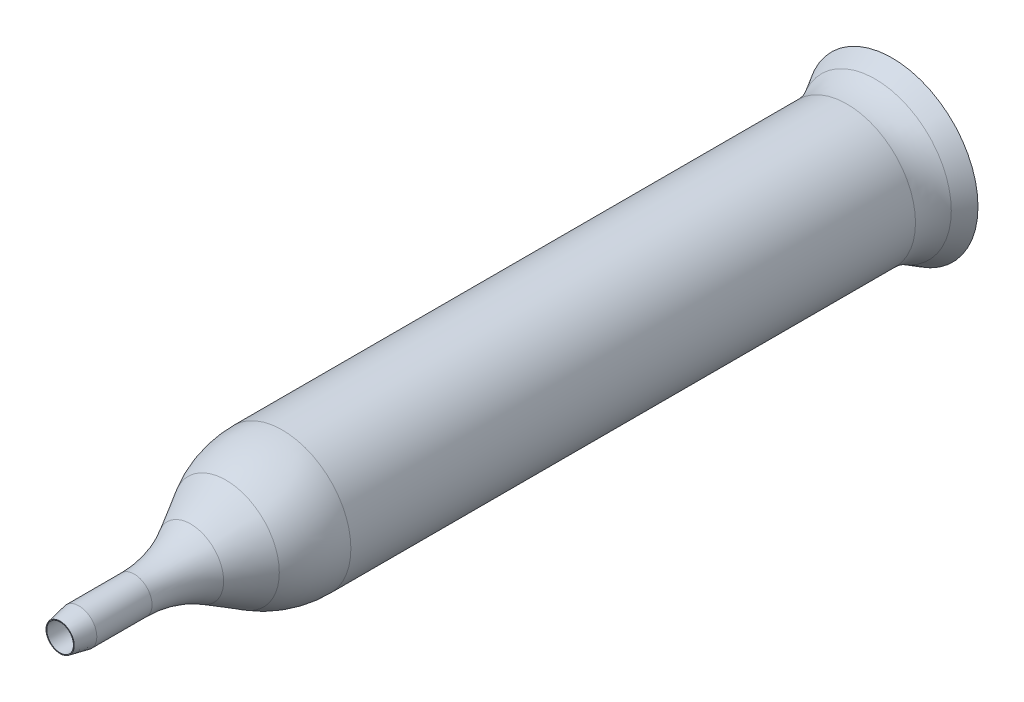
from build123d import *

# Parameters (mm, degrees)
CHAMFER1_SIZE  = 5
CHAMFER1_SIZE2 = 1


with BuildPart() as part:
    # Sketch3 → Revolve1 (revolve)
    with BuildSketch(Plane(origin=(0, 0, 0), x_dir=(0, 0, -1), z_dir=(1, 0, 0)), mode=Mode.PRIVATE) as revolve1_sk:
        with BuildLine():
            Line((74.432863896, 17), (-74.432863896, 17))
            ThreePointArc((-74.432863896, 17), (-82.197435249, 15.977774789), (-89.432863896, 12.980762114))
            Line((-89.432863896, 12.980762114), (-98.805898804, 7.569237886))
            ThreePointArc((-98.805898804, 7.569237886), (-106.041327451, 4.572225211), (-113.805898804, 3.55))
            Line((-113.805898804, 3.55), (-133.805898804, 3.55))
            Line((-133.805898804, 3.55), (-133.805898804, 4.75))
            Line((-133.805898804, 4.75), (-114.127437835, 4.75))
            ThreePointArc((-114.127437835, 4.75), (-106.362866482, 5.772225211), (-99.127437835, 8.769237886))
            Line((-99.127437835, 8.769237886), (-89.754402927, 14.180762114))
            ThreePointArc((-89.754402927, 14.180762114), (-82.51897428, 17.177774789), (-74.754402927, 18.2))
            Line((-74.754402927, 18.2), (75.245597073, 18.2))
            ThreePointArc((75.245597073, 18.2), (79.127882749, 18.711112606), (82.745597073, 20.209618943))
            Line((82.745597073, 20.209618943), (87.245597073, 22.807695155))
            Line((87.245597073, 22.807695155), (87.562029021, 22.259618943))
            Line((87.562029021, 22.259618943), (81.932863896, 19.009618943))
            ThreePointArc((81.932863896, 19.009618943), (78.315149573, 17.511112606), (74.432863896, 17))
        make_face()
    revolve(revolve1_sk.sketch.rotate(Axis((0, 0, 0), (0, 0, -1)), 90), axis=Axis((0, 0, 0), (0, 0, -1)))

    # Chamfer1
    chamfer1_edges = [part.edges().sort_by_distance(p)[0] for p in [
        (-4.75, 0, 133.805898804),
    ]]
    chamfer1_side = [part.faces().sort_by_distance(p)[0] for p in [
        (-4.75, 0, 123.966668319),
    ]]
    chamfer(chamfer1_edges, length=CHAMFER1_SIZE, length2=CHAMFER1_SIZE2, reference=chamfer1_side[0])


solid = part.part
